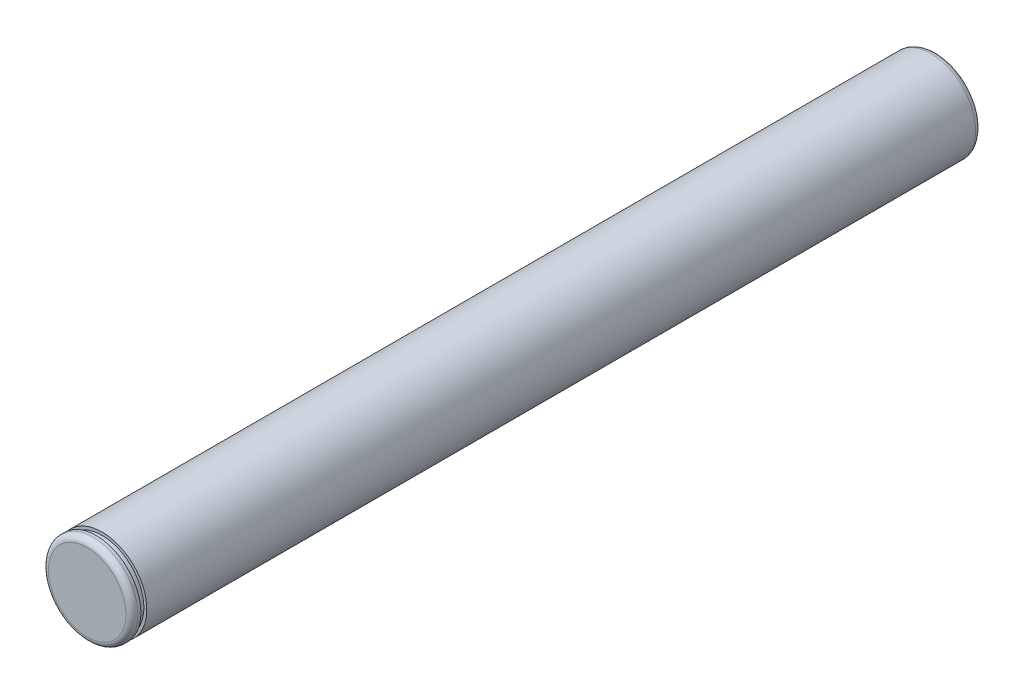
from build123d import *

# Parameters (mm, degrees)
ESQUISSE1_R        = 1.5
BOSS_EXTRU_1_DEPTH = 28.5
CONG_1_R           = 0.2
ESQUISSE2_W        = 0.1
ESQUISSE2_H        = 0.2


with BuildPart() as part:
    # Esquisse1 → Boss.-Extru.1 (new body)
    with BuildSketch(Plane.XY):
        Circle(ESQUISSE1_R)
    extrude(amount=BOSS_EXTRU_1_DEPTH)

    # Cong_1
    cong_1_edges = [part.edges().sort_by_distance(p)[0] for p in [
        (-1.5, 0, 28.5),
        (-1.5, 0, 0),
    ]]
    fillet(cong_1_edges, radius=CONG_1_R)

    # Esquisse2 → Enl_vement de mati_re-R_volution1 (revolve, cut)
    with BuildSketch(Plane(origin=(0, 0, 0), x_dir=(1, 0, 0), z_dir=(0, 1, 0)), mode=Mode.PRIVATE) as enl_vement_de_mati_re_r_volution1_sk:
        with Locations((1.45, -28.1)):
            Rectangle(ESQUISSE2_W, ESQUISSE2_H)
    revolve(enl_vement_de_mati_re_r_volution1_sk.sketch.rotate(Axis((0, 0, 24.635992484), (0, 0, 1)), 180), axis=Axis((0, 0, 24.635992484), (0, 0, 1)), mode=Mode.SUBTRACT)


solid = part.part
